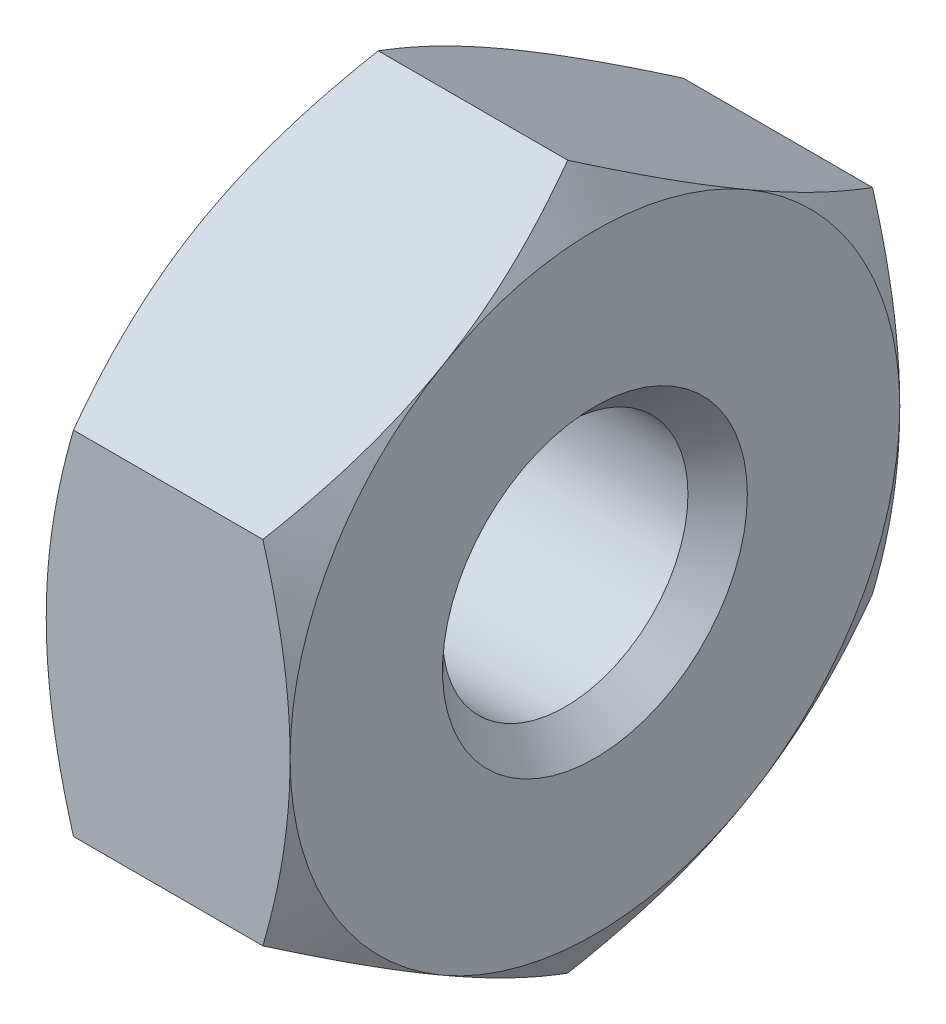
ISO-10303-21;
HEADER;
FILE_DESCRIPTION(('STEP AP214'),'2;1');
FILE_NAME('part.step','',(''),(''),'','','');
FILE_SCHEMA(('AUTOMOTIVE_DESIGN { 1 0 10303 214 1 1 1 1 }'));
ENDSEC;
DATA;
#1=APPLICATION_CONTEXT('core data for automotive mechanical design processes');
#2=APPLICATION_PROTOCOL_DEFINITION('international standard','automotive_design',2000,#1);
#3=PRODUCT_CONTEXT('',#1,'mechanical');
#4=PRODUCT('Part','Part','',(#3));
#5=PRODUCT_RELATED_PRODUCT_CATEGORY('part','',(#4));
#6=PRODUCT_DEFINITION_FORMATION('','',#4);
#7=PRODUCT_DEFINITION_CONTEXT('part definition',#1,'design');
#8=PRODUCT_DEFINITION('design','',#6,#7);
#9=PRODUCT_DEFINITION_SHAPE('','',#8);
#10=(LENGTH_UNIT() NAMED_UNIT(*) SI_UNIT(.MILLI.,.METRE.));
#11=(NAMED_UNIT(*) PLANE_ANGLE_UNIT() SI_UNIT($,.RADIAN.));
#12=(NAMED_UNIT(*) SI_UNIT($,.STERADIAN.) SOLID_ANGLE_UNIT());
#13=UNCERTAINTY_MEASURE_WITH_UNIT(LENGTH_MEASURE(1.E-05),#10,'distance_accuracy_value','');
#14=(GEOMETRIC_REPRESENTATION_CONTEXT(3) GLOBAL_UNCERTAINTY_ASSIGNED_CONTEXT((#13)) GLOBAL_UNIT_ASSIGNED_CONTEXT((#10,
#11,#12)) REPRESENTATION_CONTEXT('',''));
#15=CARTESIAN_POINT('',(0.,0.,0.));
#16=DIRECTION('',(0.,0.,1.));
#17=DIRECTION('',(1.,0.,0.));
#18=AXIS2_PLACEMENT_3D('',#15,#16,#17);
#19=CARTESIAN_POINT('',(1.77536926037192,0.,0.));
#20=DIRECTION('',(-1.,0.,0.));
#21=DIRECTION('',(0.,-1.,0.));
#22=AXIS2_PLACEMENT_3D('',#19,#20,#21);
#23=CONICAL_SURFACE('',#22,2.88907185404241,1.04719755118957);
#24=CARTESIAN_POINT('',(1.7767089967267,1.44337570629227,2.5));
#25=CARTESIAN_POINT('',(1.81063130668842,1.32586506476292,2.50000000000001));
#26=CARTESIAN_POINT('',(1.841713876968,1.20744425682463,2.50000000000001));
#27=CARTESIAN_POINT('',(1.89652772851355,0.969558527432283,2.50000000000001));
#28=CARTESIAN_POINT('',(1.92029536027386,0.850101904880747,2.50000000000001));
#29=CARTESIAN_POINT('',(1.95920267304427,0.609595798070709,2.50000000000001));
#30=CARTESIAN_POINT('',(1.97433270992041,0.488544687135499,2.50000000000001));
#31=CARTESIAN_POINT('',(1.9896432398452,0.306060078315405,2.50000000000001));
#32=CARTESIAN_POINT('',(1.99351636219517,0.244921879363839,2.50000000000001));
#33=CARTESIAN_POINT('',(1.99869890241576,0.122525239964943,2.50000000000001));
#34=CARTESIAN_POINT('',(2.0000078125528,0.0612667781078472,2.5));
#35=CARTESIAN_POINT('',(2.00000000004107,-7.49400541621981E-13,2.5));
#36=B_SPLINE_CURVE_WITH_KNOTS('',3,(#24,#25,#26,#27,#28,#29,#30,#31,#32,#33,#34,#35),
.UNSPECIFIED.,.F.,.F.,(4,2,2,2,2,4),(0.,0.367018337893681,0.732182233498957,1.09775305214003,
1.28148752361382,1.46525837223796),.UNSPECIFIED.);
#37=CARTESIAN_POINT('',(1.77670900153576,1.44337568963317,2.50000000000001));
#38=VERTEX_POINT('',#37);
#39=CARTESIAN_POINT('',(2.0000000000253,0.,2.5000000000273));
#40=VERTEX_POINT('',#39);
#41=EDGE_CURVE('E138',#38,#40,#36,.T.);
#42=ORIENTED_EDGE('',*,*,#41,.T.);
#43=CARTESIAN_POINT('',(2.00000000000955,0.,0.));
#44=DIRECTION('',(-1.,0.,0.));
#45=DIRECTION('',(0.,-1.,0.));
#46=AXIS2_PLACEMENT_3D('',#43,#44,#45);
#47=CIRCLE('',#46,2.50000000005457);
#48=CARTESIAN_POINT('',(2.0000000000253,2.16506350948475,1.25000000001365));
#49=VERTEX_POINT('',#48);
#50=EDGE_CURVE('E119',#49,#40,#47,.F.);
#51=ORIENTED_EDGE('',*,*,#50,.F.);
#52=CARTESIAN_POINT('',(2.00000000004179,2.16506350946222,1.25000000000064));
#53=CARTESIAN_POINT('',(2.00000781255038,2.13443012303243,1.30305858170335));
#54=CARTESIAN_POINT('',(1.99869890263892,2.10380089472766,1.35610996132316));
#55=CARTESIAN_POINT('',(1.99351636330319,2.04260258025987,1.46210855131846));
#56=CARTESIAN_POINT('',(1.98964324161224,2.01203348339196,1.51505578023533));
#57=CARTESIAN_POINT('',(1.97433271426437,1.92079118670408,1.67309207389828));
#58=CARTESIAN_POINT('',(1.95920267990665,1.86026563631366,1.77792540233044));
#59=CARTESIAN_POINT('',(1.92029537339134,1.74001259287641,1.98620978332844));
#60=CARTESIAN_POINT('',(1.89652774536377,1.68028428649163,2.08966224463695));
#61=CARTESIAN_POINT('',(1.8417139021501,1.5613414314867,2.29567731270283));
#62=CARTESIAN_POINT('',(1.81063133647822,1.50213103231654,2.39823273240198));
#63=CARTESIAN_POINT('',(1.7767090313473,1.44337571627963,2.4999999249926));
#64=B_SPLINE_CURVE_WITH_KNOTS('',3,(#52,#53,#54,#55,#56,#57,#58,#59,#60,#61,#62,#63),
.UNSPECIFIED.,.F.,.F.,(4,2,2,2,2,4),(0.,0.183770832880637,0.367505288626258,0.733076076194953,
1.09823994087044,1.46525824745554),.UNSPECIFIED.);
#65=EDGE_CURVE('E21',#49,#38,#64,.T.);
#66=ORIENTED_EDGE('',*,*,#65,.T.);
#67=EDGE_LOOP('',(#42,#51,#66));
#68=FACE_BOUND('',#67,.T.);
#69=ADVANCED_FACE('F17',(#68),#23,.T.);
#70=CARTESIAN_POINT('',(1.77536926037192,0.,0.));
#71=DIRECTION('',(-1.,0.,0.));
#72=DIRECTION('',(0.,-1.,0.));
#73=AXIS2_PLACEMENT_3D('',#70,#71,#72);
#74=CONICAL_SURFACE('',#73,2.88907185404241,1.04719755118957);
#75=CARTESIAN_POINT('',(2.00000000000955,0.,0.));
#76=DIRECTION('',(-1.,0.,0.));
#77=DIRECTION('',(0.,-1.,0.));
#78=AXIS2_PLACEMENT_3D('',#75,#76,#77);
#79=CIRCLE('',#78,2.50000000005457);
#80=CARTESIAN_POINT('',(2.00000000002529,-2.16506350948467,1.25000000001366));
#81=VERTEX_POINT('',#80);
#82=EDGE_CURVE('E146',#40,#81,#79,.F.);
#83=ORIENTED_EDGE('',*,*,#82,.F.);
#84=CARTESIAN_POINT('',(2.0000000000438,0.,2.50000000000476));
#85=CARTESIAN_POINT('',(2.0000078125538,-0.0612667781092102,2.50000000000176));
#86=CARTESIAN_POINT('',(1.99869890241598,-0.122525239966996,2.50000000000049));
#87=CARTESIAN_POINT('',(1.99351636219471,-0.244921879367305,2.49999999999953));
#88=CARTESIAN_POINT('',(1.98964323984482,-0.306060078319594,2.49999999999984));
#89=CARTESIAN_POINT('',(1.97433270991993,-0.488544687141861,2.50000000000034));
#90=CARTESIAN_POINT('',(1.95920267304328,-0.609595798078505,2.5000000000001));
#91=CARTESIAN_POINT('',(1.92029536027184,-0.850101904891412,2.49999999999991));
#92=CARTESIAN_POINT('',(1.89652772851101,-0.969558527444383,2.49999999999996));
#93=CARTESIAN_POINT('',(1.84171387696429,-1.20744425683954,2.50000000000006));
#94=CARTESIAN_POINT('',(1.81063130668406,-1.3258650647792,2.50000000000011));
#95=CARTESIAN_POINT('',(1.77670899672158,-1.44337570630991,2.50000000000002));
#96=B_SPLINE_CURVE_WITH_KNOTS('',3,(#84,#85,#86,#87,#88,#89,#90,#91,#92,#93,#94,#95),
.UNSPECIFIED.,.F.,.F.,(4,2,2,2,2,4),(0.,0.183770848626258,0.367505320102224,0.733076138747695,
1.09824003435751,1.46525837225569),.UNSPECIFIED.);
#97=CARTESIAN_POINT('',(1.77670901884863,-1.44337569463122,2.49999996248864));
#98=VERTEX_POINT('',#97);
#99=EDGE_CURVE('E296',#40,#98,#96,.T.);
#100=ORIENTED_EDGE('',*,*,#99,.T.);
#101=CARTESIAN_POINT('',(1.77670903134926,-1.44337571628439,2.49999992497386));
#102=CARTESIAN_POINT('',(1.81063133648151,-1.50213103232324,2.39823273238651));
#103=CARTESIAN_POINT('',(1.84171390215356,-1.5613414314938,2.29567731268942));
#104=CARTESIAN_POINT('',(1.89652774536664,-1.68028428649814,2.08966224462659));
#105=CARTESIAN_POINT('',(1.92029537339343,-1.74001259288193,1.98620978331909));
#106=CARTESIAN_POINT('',(1.95920267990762,-1.86026563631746,1.77792540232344));
#107=CARTESIAN_POINT('',(1.97433271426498,-1.92079118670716,1.67309207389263));
#108=CARTESIAN_POINT('',(1.98964324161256,-2.01203348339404,1.51505578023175));
#109=CARTESIAN_POINT('',(1.99351636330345,-2.04260258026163,1.46210855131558));
#110=CARTESIAN_POINT('',(1.99869890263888,-2.10380089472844,1.35610996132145));
#111=CARTESIAN_POINT('',(2.00000781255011,-2.13443012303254,1.30305858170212));
#112=CARTESIAN_POINT('',(2.00000000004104,-2.1650635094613,1.24999999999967));
#113=B_SPLINE_CURVE_WITH_KNOTS('',3,(#101,#102,#103,#104,#105,#106,#107,#108,#109,#110,#111,
#112),.UNSPECIFIED.,.F.,.F.,(4,2,2,2,2,4),(0.,0.367018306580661,0.732182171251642,
1.09775295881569,1.28148741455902,1.4652582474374),.UNSPECIFIED.);
#114=EDGE_CURVE('E304',#98,#81,#113,.T.);
#115=ORIENTED_EDGE('',*,*,#114,.T.);
#116=EDGE_LOOP('',(#83,#100,#115));
#117=FACE_BOUND('',#116,.T.);
#118=ADVANCED_FACE('F311',(#117),#74,.T.);
#119=CARTESIAN_POINT('',(1.77536926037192,0.,0.));
#120=DIRECTION('',(-1.,0.,0.));
#121=DIRECTION('',(0.,-1.,0.));
#122=AXIS2_PLACEMENT_3D('',#119,#120,#121);
#123=CONICAL_SURFACE('',#122,2.88907185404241,1.04719755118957);
#124=CARTESIAN_POINT('',(2.00000000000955,0.,0.));
#125=DIRECTION('',(-1.,0.,0.));
#126=DIRECTION('',(0.,-1.,0.));
#127=AXIS2_PLACEMENT_3D('',#124,#125,#126);
#128=CIRCLE('',#127,2.50000000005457);
#129=CARTESIAN_POINT('',(2.00000000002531,-2.16506350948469,-1.25000000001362));
#130=VERTEX_POINT('',#129);
#131=CARTESIAN_POINT('',(2.0000000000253,0.,-2.50000000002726));
#132=VERTEX_POINT('',#131);
#133=EDGE_CURVE('E332',#130,#132,#128,.F.);
#134=ORIENTED_EDGE('',*,*,#133,.F.);
#135=CARTESIAN_POINT('',(2.00000000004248,-2.16506350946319,-1.25000000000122));
#136=CARTESIAN_POINT('',(2.00000781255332,-2.13443012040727,-1.30305858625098));
#137=CARTESIAN_POINT('',(1.99869890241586,-2.10380088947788,-1.35610997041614));
#138=CARTESIAN_POINT('',(1.99351636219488,-2.04260256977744,-1.46210856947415));
#139=CARTESIAN_POINT('',(1.98964323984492,-2.01203347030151,-1.5150558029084));
#140=CARTESIAN_POINT('',(1.97433270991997,-1.92079116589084,-1.67309210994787));
#141=CARTESIAN_POINT('',(1.95920267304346,-1.86026561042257,-1.777925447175));
#142=CARTESIAN_POINT('',(1.92029536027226,-1.74001255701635,-1.98620984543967));
#143=CARTESIAN_POINT('',(1.89652772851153,-1.68028424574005,-2.08966231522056));
#144=CARTESIAN_POINT('',(1.84171387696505,-1.56134138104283,-2.29567740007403));
#145=CARTESIAN_POINT('',(1.81063130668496,-1.50213097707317,-2.3982328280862));
#146=CARTESIAN_POINT('',(1.77670899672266,-1.44337565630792,-2.50000002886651));
#147=B_SPLINE_CURVE_WITH_KNOTS('',3,(#135,#136,#137,#138,#139,#140,#141,#142,#143,#144,#145,
#146),.UNSPECIFIED.,.F.,.F.,(4,2,2,2,2,4),(0.,0.183770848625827,0.367505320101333,
0.733076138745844,1.09824003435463,1.4652583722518),.UNSPECIFIED.);
#148=CARTESIAN_POINT('',(1.77670901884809,-1.44337562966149,-2.49999999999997));
#149=VERTEX_POINT('',#148);
#150=EDGE_CURVE('E474',#130,#149,#147,.T.);
#151=ORIENTED_EDGE('',*,*,#150,.T.);
#152=CARTESIAN_POINT('',(1.77670903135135,-1.44337558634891,-2.49999999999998));
#153=CARTESIAN_POINT('',(1.81063133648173,-1.3258649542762,-2.49999999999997));
#154=CARTESIAN_POINT('',(1.84171390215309,-1.20744415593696,-2.49999999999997));
#155=CARTESIAN_POINT('',(1.89652774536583,-0.969558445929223,-2.49999999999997));
#156=CARTESIAN_POINT('',(1.92029537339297,-0.85010183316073,-2.49999999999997));
#157=CARTESIAN_POINT('',(1.95920267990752,-0.609595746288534,-2.49999999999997));
#158=CARTESIAN_POINT('',(1.97433271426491,-0.488544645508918,-2.49999999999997));
#159=CARTESIAN_POINT('',(1.98964324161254,-0.30606005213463,-2.49999999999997));
#160=CARTESIAN_POINT('',(1.99351636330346,-0.244921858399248,-2.49999999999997));
#161=CARTESIAN_POINT('',(1.99869890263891,-0.122525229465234,-2.49999999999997));
#162=CARTESIAN_POINT('',(2.00000781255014,-0.0612667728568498,-2.49999999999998));
#163=CARTESIAN_POINT('',(2.00000000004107,8.04911692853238E-13,-2.5));
#164=B_SPLINE_CURVE_WITH_KNOTS('',3,(#152,#153,#154,#155,#156,#157,#158,#159,#160,#161,#162,
#163),.UNSPECIFIED.,.F.,.F.,(4,2,2,2,2,4),(0.,0.367018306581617,0.732182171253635,
1.09775295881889,1.28148741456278,1.4652582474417),.UNSPECIFIED.);
#165=EDGE_CURVE('E303',#149,#132,#164,.T.);
#166=ORIENTED_EDGE('',*,*,#165,.T.);
#167=EDGE_LOOP('',(#134,#151,#166));
#168=FACE_BOUND('',#167,.T.);
#169=ADVANCED_FACE('F173',(#168),#123,.T.);
#170=CARTESIAN_POINT('',(1.77536926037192,0.,0.));
#171=DIRECTION('',(-1.,0.,0.));
#172=DIRECTION('',(0.,-1.,0.));
#173=AXIS2_PLACEMENT_3D('',#170,#171,#172);
#174=CONICAL_SURFACE('',#173,2.88907185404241,1.04719755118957);
#175=CARTESIAN_POINT('',(1.77670899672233,1.44337565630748,-2.50000002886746));
#176=CARTESIAN_POINT('',(1.81063130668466,1.50213097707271,-2.39823282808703));
#177=CARTESIAN_POINT('',(1.84171387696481,1.56134138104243,-2.29567740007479));
#178=CARTESIAN_POINT('',(1.8965277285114,1.68028424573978,-2.08966231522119));
#179=CARTESIAN_POINT('',(1.92029536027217,1.74001255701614,-1.98620984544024));
#180=CARTESIAN_POINT('',(1.95920267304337,1.86026561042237,-1.77792544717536));
#181=CARTESIAN_POINT('',(1.97433270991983,1.92079116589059,-1.67309210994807));
#182=CARTESIAN_POINT('',(1.98964323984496,2.01203347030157,-1.51505580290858));
#183=CARTESIAN_POINT('',(1.99351636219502,2.04260256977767,-1.46210856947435));
#184=CARTESIAN_POINT('',(1.99869890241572,2.10380088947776,-1.35610997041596));
#185=CARTESIAN_POINT('',(2.0000078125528,2.13443012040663,-1.30305858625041));
#186=CARTESIAN_POINT('',(2.00000000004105,2.16506350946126,-1.24999999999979));
#187=B_SPLINE_CURVE_WITH_KNOTS('',3,(#175,#176,#177,#178,#179,#180,#181,#182,#183,#184,#185,
#186),.UNSPECIFIED.,.F.,.F.,(4,2,2,2,2,4),(0.,0.367018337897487,0.732182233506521,
1.09775305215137,1.28148752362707,1.46525837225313),.UNSPECIFIED.);
#188=CARTESIAN_POINT('',(1.77670900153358,1.44337566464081,-2.50000001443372));
#189=VERTEX_POINT('',#188);
#190=CARTESIAN_POINT('',(2.0000000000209,2.16506350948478,-1.25000000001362));
#191=VERTEX_POINT('',#190);
#192=EDGE_CURVE('E147',#189,#191,#187,.T.);
#193=ORIENTED_EDGE('',*,*,#192,.T.);
#194=CARTESIAN_POINT('',(2.00000000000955,0.,0.));
#195=DIRECTION('',(-1.,0.,0.));
#196=DIRECTION('',(0.,-1.,0.));
#197=AXIS2_PLACEMENT_3D('',#194,#195,#196);
#198=CIRCLE('',#197,2.50000000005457);
#199=EDGE_CURVE('E122',#132,#191,#198,.F.);
#200=ORIENTED_EDGE('',*,*,#199,.F.);
#201=CARTESIAN_POINT('',(2.0000000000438,0.,-2.50000000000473));
#202=CARTESIAN_POINT('',(2.00000781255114,0.0612667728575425,-2.50000000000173));
#203=CARTESIAN_POINT('',(1.99869890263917,0.122525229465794,-2.50000000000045));
#204=CARTESIAN_POINT('',(1.99351636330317,0.244921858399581,-2.49999999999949));
#205=CARTESIAN_POINT('',(1.98964324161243,0.306060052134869,-2.4999999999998));
#206=CARTESIAN_POINT('',(1.9743327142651,0.488544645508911,-2.50000000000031));
#207=CARTESIAN_POINT('',(1.9592026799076,0.609595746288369,-2.50000000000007));
#208=CARTESIAN_POINT('',(1.920295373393,0.85010183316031,-2.49999999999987));
#209=CARTESIAN_POINT('',(1.89652774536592,0.969558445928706,-2.49999999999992));
#210=CARTESIAN_POINT('',(1.84171390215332,1.20744415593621,-2.50000000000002));
#211=CARTESIAN_POINT('',(1.81063133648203,1.32586495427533,-2.50000000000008));
#212=CARTESIAN_POINT('',(1.77670903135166,1.44337558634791,-2.5));
#213=B_SPLINE_CURVE_WITH_KNOTS('',3,(#201,#202,#203,#204,#205,#206,#207,#208,#209,#210,#211,
#212),.UNSPECIFIED.,.F.,.F.,(4,2,2,2,2,4),(0.,0.183770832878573,0.367505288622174,
0.733076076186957,1.09823994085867,1.46525824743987),.UNSPECIFIED.);
#214=EDGE_CURVE('E151',#132,#189,#213,.T.);
#215=ORIENTED_EDGE('',*,*,#214,.T.);
#216=EDGE_LOOP('',(#193,#200,#215));
#217=FACE_BOUND('',#216,.T.);
#218=ADVANCED_FACE('F168',(#217),#174,.T.);
#219=CARTESIAN_POINT('',(2.,1.87500000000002,0.));
#220=DIRECTION('',(1.,0.,0.));
#221=DIRECTION('',(0.,0.,-1.));
#222=AXIS2_PLACEMENT_3D('',#219,#220,#221);
#223=PLANE('',#222);
#224=CARTESIAN_POINT('',(2.00000000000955,0.,0.));
#225=DIRECTION('',(1.,0.,0.));
#226=DIRECTION('',(0.,0.,-1.));
#227=AXIS2_PLACEMENT_3D('',#224,#225,#226);
#228=CIRCLE('',#227,1.25000000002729);
#229=CARTESIAN_POINT('',(2.00000000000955,0.,-1.25000000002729));
#230=VERTEX_POINT('',#229);
#231=EDGE_CURVE('E126',#230,#230,#228,.F.);
#232=ORIENTED_EDGE('',*,*,#231,.T.);
#233=EDGE_LOOP('',(#232));
#234=FACE_BOUND('',#233,.T.);
#235=ORIENTED_EDGE('',*,*,#199,.T.);
#236=CARTESIAN_POINT('',(2.00000000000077,0.,0.));
#237=DIRECTION('',(-1.,0.,0.));
#238=DIRECTION('',(0.,-1.,0.));
#239=AXIS2_PLACEMENT_3D('',#236,#237,#238);
#240=CIRCLE('',#239,2.50000000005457);
#241=EDGE_CURVE('E114',#191,#49,#240,.F.);
#242=ORIENTED_EDGE('',*,*,#241,.T.);
#243=ORIENTED_EDGE('',*,*,#50,.T.);
#244=ORIENTED_EDGE('',*,*,#82,.T.);
#245=CARTESIAN_POINT('',(2.00000000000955,0.,0.));
#246=DIRECTION('',(-1.,0.,0.));
#247=DIRECTION('',(0.,-1.,0.));
#248=AXIS2_PLACEMENT_3D('',#245,#246,#247);
#249=CIRCLE('',#248,2.50000000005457);
#250=EDGE_CURVE('E149',#81,#130,#249,.F.);
#251=ORIENTED_EDGE('',*,*,#250,.T.);
#252=ORIENTED_EDGE('',*,*,#133,.T.);
#253=EDGE_LOOP('',(#235,#242,#243,#244,#251,#252));
#254=FACE_BOUND('',#253,.T.);
#255=ADVANCED_FACE('F116',(#234,#254),#223,.T.);
#256=CARTESIAN_POINT('',(1.99999999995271,0.,0.));
#257=DIRECTION('',(1.,0.,0.));
#258=DIRECTION('',(0.,0.,-1.));
#259=AXIS2_PLACEMENT_3D('',#256,#257,#258);
#260=CONICAL_SURFACE('',#259,1.24999999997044,0.78539816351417);
#261=ORIENTED_EDGE('',*,*,#231,.F.);
#262=EDGE_LOOP('',(#261));
#263=FACE_BOUND('',#262,.T.);
#264=CARTESIAN_POINT('',(1.75650000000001,0.,0.));
#265=DIRECTION('',(1.,0.,0.));
#266=DIRECTION('',(0.,1.,0.));
#267=AXIS2_PLACEMENT_3D('',#264,#265,#266);
#268=CIRCLE('',#267,1.0065);
#269=CARTESIAN_POINT('',(1.75650000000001,1.00650000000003,0.));
#270=VERTEX_POINT('',#269);
#271=EDGE_CURVE('E336',#270,#270,#268,.F.);
#272=ORIENTED_EDGE('',*,*,#271,.T.);
#273=EDGE_LOOP('',(#272));
#274=FACE_BOUND('',#273,.T.);
#275=ADVANCED_FACE('F180',(#263,#274),#260,.F.);
#276=CARTESIAN_POINT('',(1.77536926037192,0.,0.));
#277=DIRECTION('',(-1.,0.,0.));
#278=DIRECTION('',(0.,-1.,0.));
#279=AXIS2_PLACEMENT_3D('',#276,#277,#278);
#280=CONICAL_SURFACE('',#279,2.88907185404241,1.04719755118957);
#281=ORIENTED_EDGE('',*,*,#250,.F.);
#282=CARTESIAN_POINT('',(2.00000000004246,-2.16506350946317,1.25000000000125));
#283=CARTESIAN_POINT('',(2.00000781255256,-2.19569689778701,1.19694141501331));
#284=CARTESIAN_POINT('',(1.99869890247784,-2.22632612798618,1.14389003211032));
#285=CARTESIAN_POINT('',(1.99351636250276,-2.2875244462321,1.03789143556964));
#286=CARTESIAN_POINT('',(1.9896432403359,-2.31809354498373,0.98494420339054));
#287=CARTESIAN_POINT('',(1.97433271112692,-2.4093358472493,0.826907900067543));
#288=CARTESIAN_POINT('',(1.95920267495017,-2.46986140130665,0.722074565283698));
#289=CARTESIAN_POINT('',(1.92029536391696,-2.59011445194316,0.513790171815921));
#290=CARTESIAN_POINT('',(1.89652773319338,-2.64984276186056,0.410337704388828));
#291=CARTESIAN_POINT('',(1.8417138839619,-2.76878562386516,0.204322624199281));
#292=CARTESIAN_POINT('',(1.81063131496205,-2.82799602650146,0.101767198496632));
#293=CARTESIAN_POINT('',(1.776709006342,-2.886751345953,-8.50187975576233E-12));
#294=B_SPLINE_CURVE_WITH_KNOTS('',3,(#282,#283,#284,#285,#286,#287,#288,#289,#290,#291,#292,
#293),.UNSPECIFIED.,.F.,.F.,(4,2,2,2,2,4),(0.,0.183770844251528,0.367505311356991,
0.733076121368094,1.09824000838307,1.46525833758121),.UNSPECIFIED.);
#295=CARTESIAN_POINT('',(1.77670900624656,-2.88675134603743,4.2708891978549E-12));
#296=VERTEX_POINT('',#295);
#297=EDGE_CURVE('E193',#81,#296,#294,.T.);
#298=ORIENTED_EDGE('',*,*,#297,.T.);
#299=CARTESIAN_POINT('',(1.776709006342,-2.88675134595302,8.53830894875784E-12));
#300=CARTESIAN_POINT('',(1.81063131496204,-2.82799602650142,-0.101767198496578));
#301=CARTESIAN_POINT('',(1.8417138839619,-2.76878562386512,-0.204322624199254));
#302=CARTESIAN_POINT('',(1.89652773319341,-2.64984276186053,-0.410337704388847));
#303=CARTESIAN_POINT('',(1.92029536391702,-2.59011445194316,-0.513790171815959));
#304=CARTESIAN_POINT('',(1.95920267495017,-2.46986140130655,-0.722074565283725));
#305=CARTESIAN_POINT('',(1.97433271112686,-2.40933584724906,-0.826907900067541));
#306=CARTESIAN_POINT('',(1.98964324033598,-2.31809354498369,-0.984944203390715));
#307=CARTESIAN_POINT('',(1.99351636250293,-2.28752444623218,-1.03789143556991));
#308=CARTESIAN_POINT('',(1.99869890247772,-2.22632612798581,-1.14389003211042));
#309=CARTESIAN_POINT('',(2.00000781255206,-2.19569689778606,-1.19694141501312));
#310=CARTESIAN_POINT('',(2.00000000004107,-2.16506350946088,-1.25000000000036));
#311=B_SPLINE_CURVE_WITH_KNOTS('',3,(#299,#300,#301,#302,#303,#304,#305,#306,#307,#308,#309,
#310),.UNSPECIFIED.,.F.,.F.,(4,2,2,2,2,4),(0.,0.367018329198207,0.732182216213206,
1.09775302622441,1.28148749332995,1.46525833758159),.UNSPECIFIED.);
#312=EDGE_CURVE('E199',#296,#130,#311,.T.);
#313=ORIENTED_EDGE('',*,*,#312,.T.);
#314=EDGE_LOOP('',(#281,#298,#313));
#315=FACE_BOUND('',#314,.T.);
#316=ADVANCED_FACE('F184',(#315),#280,.T.);
#317=CARTESIAN_POINT('',(1.77536926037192,0.,0.));
#318=DIRECTION('',(-1.,0.,0.));
#319=DIRECTION('',(0.,-1.,0.));
#320=AXIS2_PLACEMENT_3D('',#317,#318,#319);
#321=CONICAL_SURFACE('',#320,2.88907185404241,1.04719755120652);
#322=CARTESIAN_POINT('',(1.77670900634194,2.88675134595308,-8.50708392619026E-12));
#323=CARTESIAN_POINT('',(1.81063131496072,2.82799602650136,0.101767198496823));
#324=CARTESIAN_POINT('',(1.8417138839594,2.76878562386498,0.204322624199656));
#325=CARTESIAN_POINT('',(1.89652773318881,2.64984276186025,0.410337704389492));
#326=CARTESIAN_POINT('',(1.92029536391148,2.59011445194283,0.513790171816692));
#327=CARTESIAN_POINT('',(1.95920267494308,2.46986140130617,0.722074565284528));
#328=CARTESIAN_POINT('',(1.97433271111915,2.4093358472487,0.826907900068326));
#329=CARTESIAN_POINT('',(1.98964324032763,2.31809354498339,0.984944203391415));
#330=CARTESIAN_POINT('',(1.99351636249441,2.28752444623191,1.03789143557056));
#331=CARTESIAN_POINT('',(1.99869890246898,2.22632612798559,1.14389003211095));
#332=CARTESIAN_POINT('',(2.00000781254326,2.19569689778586,1.19694141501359));
#333=CARTESIAN_POINT('',(2.00000000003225,2.16506350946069,1.25000000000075));
#334=B_SPLINE_CURVE_WITH_KNOTS('',3,(#322,#323,#324,#325,#326,#327,#328,#329,#330,#331,#332,
#333),.UNSPECIFIED.,.F.,.F.,(4,2,2,2,2,4),(0.,0.367018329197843,0.732182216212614,
1.09775302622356,1.2814874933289,1.46525833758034),.UNSPECIFIED.);
#335=CARTESIAN_POINT('',(1.77670900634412,2.88675134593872,0.));
#336=VERTEX_POINT('',#335);
#337=EDGE_CURVE('E133',#336,#49,#334,.T.);
#338=ORIENTED_EDGE('',*,*,#337,.T.);
#339=ORIENTED_EDGE('',*,*,#241,.F.);
#340=CARTESIAN_POINT('',(2.00000000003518,2.16506350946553,-1.25000000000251));
#341=CARTESIAN_POINT('',(2.00000781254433,2.19569689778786,-1.19694141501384));
#342=CARTESIAN_POINT('',(1.99869890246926,2.22632612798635,-1.14389003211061));
#343=CARTESIAN_POINT('',(1.9935163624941,2.28752444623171,-1.03789143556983));
#344=CARTESIAN_POINT('',(1.98964324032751,2.31809354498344,-0.9849442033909));
#345=CARTESIAN_POINT('',(1.97433271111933,2.40933584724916,-0.826907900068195));
#346=CARTESIAN_POINT('',(1.95920267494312,2.46986140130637,-0.72207456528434));
#347=CARTESIAN_POINT('',(1.92029536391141,2.5901144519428,-0.513790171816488));
#348=CARTESIAN_POINT('',(1.89652773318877,2.64984276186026,-0.410337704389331));
#349=CARTESIAN_POINT('',(1.84171388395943,2.76878562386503,-0.204322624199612));
#350=CARTESIAN_POINT('',(1.81063131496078,2.82799602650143,-0.101767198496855));
#351=CARTESIAN_POINT('',(1.77670900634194,2.88675134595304,8.47238945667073E-12));
#352=B_SPLINE_CURVE_WITH_KNOTS('',3,(#340,#341,#342,#343,#344,#345,#346,#347,#348,#349,#350,
#351),.UNSPECIFIED.,.F.,.F.,(4,2,2,2,2,4),(0.,0.183770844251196,0.367505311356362,
0.733076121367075,1.09824000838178,1.46525833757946),.UNSPECIFIED.);
#353=EDGE_CURVE('E140',#191,#336,#352,.T.);
#354=ORIENTED_EDGE('',*,*,#353,.T.);
#355=EDGE_LOOP('',(#338,#339,#354));
#356=FACE_BOUND('',#355,.T.);
#357=ADVANCED_FACE('F139',(#356),#321,.T.);
#358=CARTESIAN_POINT('',(1.,0.,0.));
#359=DIRECTION('',(1.,0.,0.));
#360=DIRECTION('',(0.,1.,0.));
#361=AXIS2_PLACEMENT_3D('',#358,#359,#360);
#362=CYLINDRICAL_SURFACE('',#361,1.0065);
#363=ORIENTED_EDGE('',*,*,#271,.F.);
#364=EDGE_LOOP('',(#363));
#365=FACE_BOUND('',#364,.T.);
#366=CARTESIAN_POINT('',(0.243500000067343,0.,0.));
#367=DIRECTION('',(-1.,0.,0.));
#368=DIRECTION('',(0.,1.,0.));
#369=AXIS2_PLACEMENT_3D('',#366,#367,#368);
#370=CIRCLE('',#369,1.00650000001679);
#371=CARTESIAN_POINT('',(0.24350000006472,1.00649999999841,0.));
#372=VERTEX_POINT('',#371);
#373=CARTESIAN_POINT('',(0.243500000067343,-1.00650000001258,0.));
#374=VERTEX_POINT('',#373);
#375=EDGE_CURVE('E394',#372,#374,#370,.T.);
#376=ORIENTED_EDGE('',*,*,#375,.T.);
#377=CARTESIAN_POINT('',(0.243500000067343,0.,0.));
#378=DIRECTION('',(-1.,0.,0.));
#379=DIRECTION('',(0.,1.,0.));
#380=AXIS2_PLACEMENT_3D('',#377,#378,#379);
#381=CIRCLE('',#380,1.00650000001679);
#382=EDGE_CURVE('E400',#374,#372,#381,.T.);
#383=ORIENTED_EDGE('',*,*,#382,.T.);
#384=EDGE_LOOP('',(#376,#383));
#385=FACE_BOUND('',#384,.T.);
#386=ADVANCED_FACE('F415',(#365,#385),#362,.F.);
#387=CARTESIAN_POINT('',(2.99999999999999,2.88675134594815,0.));
#388=DIRECTION('',(0.,-0.866025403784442,0.500000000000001));
#389=DIRECTION('',(0.,-0.500000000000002,-0.866025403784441));
#390=AXIS2_PLACEMENT_3D('',#387,#388,#389);
#391=PLANE('',#390);
#392=CARTESIAN_POINT('',(0.223290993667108,2.8867513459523,7.14359127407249E-12));
#393=CARTESIAN_POINT('',(0.189368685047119,2.82799602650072,-0.101767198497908));
#394=CARTESIAN_POINT('',(0.158286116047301,2.76878562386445,-0.204322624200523));
#395=CARTESIAN_POINT('',(0.103472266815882,2.64984276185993,-0.410337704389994));
#396=CARTESIAN_POINT('',(0.0797046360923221,2.59011445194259,-0.513790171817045));
#397=CARTESIAN_POINT('',(0.0407973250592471,2.46986140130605,-0.722074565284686));
#398=CARTESIAN_POINT('',(0.0256672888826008,2.40933584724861,-0.826907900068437));
#399=CARTESIAN_POINT('',(0.0103567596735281,2.3180935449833,-0.984944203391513));
#400=CARTESIAN_POINT('',(0.00648363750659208,2.28752444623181,-1.03789143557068));
#401=CARTESIAN_POINT('',(0.00130109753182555,2.22632612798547,-1.14389003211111));
#402=CARTESIAN_POINT('',(-7.81254251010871E-06,2.19569689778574,-1.19694141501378));
#403=CARTESIAN_POINT('',(-3.15164561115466E-11,2.16506350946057,-1.25000000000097));
#404=B_SPLINE_CURVE_WITH_KNOTS('',3,(#392,#393,#394,#395,#396,#397,#398,#399,#400,#401,#402,
#403),.UNSPECIFIED.,.F.,.F.,(4,2,2,2,2,4),(0.,0.367018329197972,0.732182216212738,
1.09775302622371,1.28148749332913,1.46525833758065),.UNSPECIFIED.);
#405=CARTESIAN_POINT('',(0.223290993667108,2.88675134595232,0.));
#406=VERTEX_POINT('',#405);
#407=CARTESIAN_POINT('',(-1.57512891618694E-11,2.16506350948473,-1.25000000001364));
#408=VERTEX_POINT('',#407);
#409=EDGE_CURVE('E440',#406,#408,#404,.T.);
#410=ORIENTED_EDGE('',*,*,#409,.F.);
#411=DIRECTION('',(1.,0.,0.));
#412=VECTOR('',#411,1.);
#413=CARTESIAN_POINT('',(2.99999999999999,2.88675134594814,0.));
#414=LINE('',#413,#412);
#415=EDGE_CURVE('E142',#406,#336,#414,.T.);
#416=ORIENTED_EDGE('',*,*,#415,.T.);
#417=ORIENTED_EDGE('',*,*,#353,.F.);
#418=ORIENTED_EDGE('',*,*,#192,.F.);
#419=DIRECTION('',(1.,0.,0.));
#420=VECTOR('',#419,1.);
#421=CARTESIAN_POINT('',(2.99999999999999,1.4433756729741,-2.49999999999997));
#422=LINE('',#421,#420);
#423=CARTESIAN_POINT('',(0.223290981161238,1.44337562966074,-2.50000000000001));
#424=VERTEX_POINT('',#423);
#425=EDGE_CURVE('E207',#189,#424,#422,.F.);
#426=ORIENTED_EDGE('',*,*,#425,.T.);
#427=CARTESIAN_POINT('',(-3.54438700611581E-11,2.16506350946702,-1.2500000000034));
#428=CARTESIAN_POINT('',(-7.81254468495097E-06,2.13443012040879,-1.30305858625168));
#429=CARTESIAN_POINT('',(0.00130109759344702,2.10380088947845,-1.35610997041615));
#430=CARTESIAN_POINT('',(0.0064836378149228,2.04260256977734,-1.46210856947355));
#431=CARTESIAN_POINT('',(0.010356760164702,2.0120334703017,-1.51505580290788));
#432=CARTESIAN_POINT('',(0.0256672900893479,1.92079116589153,-1.6730921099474));
#433=CARTESIAN_POINT('',(0.0407973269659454,1.86026561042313,-1.77792544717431));
#434=CARTESIAN_POINT('',(0.0797046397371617,1.74001255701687,-1.98620984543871));
#435=CARTESIAN_POINT('',(0.103472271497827,1.68028424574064,-2.08966231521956));
#436=CARTESIAN_POINT('',(0.158286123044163,1.56134138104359,-2.29567740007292));
#437=CARTESIAN_POINT('',(0.189368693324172,1.50213097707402,-2.39823282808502));
#438=CARTESIAN_POINT('',(0.223291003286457,1.44337565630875,-2.50000002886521));
#439=B_SPLINE_CURVE_WITH_KNOTS('',3,(#427,#428,#429,#430,#431,#432,#433,#434,#435,#436,#437,
#438),.UNSPECIFIED.,.F.,.F.,(4,2,2,2,2,4),(0.,0.183770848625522,0.367505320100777,
0.733076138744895,1.09824003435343,1.46525837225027),.UNSPECIFIED.);
#440=EDGE_CURVE('E241',#408,#424,#439,.T.);
#441=ORIENTED_EDGE('',*,*,#440,.F.);
#442=EDGE_LOOP('',(#410,#416,#417,#418,#426,#441));
#443=FACE_BOUND('',#442,.T.);
#444=ADVANCED_FACE('F165',(#443),#391,.F.);
#445=CARTESIAN_POINT('',(2.99999999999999,1.4433756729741,-2.49999999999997));
#446=DIRECTION('',(0.,0.,1.));
#447=DIRECTION('',(1.,0.,0.));
#448=AXIS2_PLACEMENT_3D('',#445,#446,#447);
#449=PLANE('',#448);
#450=CARTESIAN_POINT('',(0.223290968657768,1.44337558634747,-2.5));
#451=CARTESIAN_POINT('',(0.189368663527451,1.32586495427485,-2.49999999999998));
#452=CARTESIAN_POINT('',(0.158286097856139,1.20744415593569,-2.49999999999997));
#453=CARTESIAN_POINT('',(0.103472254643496,0.969558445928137,-2.49999999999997));
#454=CARTESIAN_POINT('',(0.0797046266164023,0.850101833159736,-2.49999999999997));
#455=CARTESIAN_POINT('',(0.0407973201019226,0.609595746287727,-2.49999999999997));
#456=CARTESIAN_POINT('',(0.0256672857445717,0.488544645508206,-2.49999999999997));
#457=CARTESIAN_POINT('',(0.010356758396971,0.306060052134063,-2.49999999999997));
#458=CARTESIAN_POINT('',(0.00648363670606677,0.244921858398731,-2.49999999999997));
#459=CARTESIAN_POINT('',(0.00130109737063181,0.122525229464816,-2.49999999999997));
#460=CARTESIAN_POINT('',(-7.81254058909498E-06,0.0612667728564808,-2.49999999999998));
#461=CARTESIAN_POINT('',(-3.15008436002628E-11,-1.12410081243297E-12,-2.5));
#462=B_SPLINE_CURVE_WITH_KNOTS('',3,(#450,#451,#452,#453,#454,#455,#456,#457,#458,#459,#460,
#461),.UNSPECIFIED.,.F.,.F.,(4,2,2,2,2,4),(0.,0.367018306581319,0.732182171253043,
1.097752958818,1.28148741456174,1.46525824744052),.UNSPECIFIED.);
#463=CARTESIAN_POINT('',(-1.57495544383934E-11,0.,-2.50000000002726));
#464=VERTEX_POINT('',#463);
#465=EDGE_CURVE('E454',#424,#464,#462,.T.);
#466=ORIENTED_EDGE('',*,*,#465,.F.);
#467=ORIENTED_EDGE('',*,*,#425,.F.);
#468=ORIENTED_EDGE('',*,*,#214,.F.);
#469=ORIENTED_EDGE('',*,*,#165,.F.);
#470=DIRECTION('',(1.,0.,0.));
#471=VECTOR('',#470,1.);
#472=CARTESIAN_POINT('',(3.,-1.44337567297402,-2.5));
#473=LINE('',#472,#471);
#474=CARTESIAN_POINT('',(0.223290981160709,-1.44337569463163,-2.49999996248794));
#475=VERTEX_POINT('',#474);
#476=EDGE_CURVE('E206',#149,#475,#473,.F.);
#477=ORIENTED_EDGE('',*,*,#476,.T.);
#478=CARTESIAN_POINT('',(-3.54421353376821E-11,0.,-2.50000000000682));
#479=CARTESIAN_POINT('',(-7.81254469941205E-06,-0.0612667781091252,-2.50000000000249));
#480=CARTESIAN_POINT('',(0.00130109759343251,-0.122525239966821,-2.50000000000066));
#481=CARTESIAN_POINT('',(0.00648363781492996,-0.244921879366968,-2.49999999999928));
#482=CARTESIAN_POINT('',(0.0103567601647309,-0.306060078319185,-2.49999999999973));
#483=CARTESIAN_POINT('',(0.0256672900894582,-0.488544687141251,-2.50000000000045));
#484=CARTESIAN_POINT('',(0.0407973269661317,-0.609595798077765,-2.50000000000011));
#485=CARTESIAN_POINT('',(0.0797046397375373,-0.850101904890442,-2.49999999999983));
#486=CARTESIAN_POINT('',(0.103472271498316,-0.969558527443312,-2.4999999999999));
#487=CARTESIAN_POINT('',(0.158286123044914,-1.20744425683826,-2.50000000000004));
#488=CARTESIAN_POINT('',(0.189368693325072,-1.3258650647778,-2.50000000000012));
#489=CARTESIAN_POINT('',(0.223291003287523,-1.4433757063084,-2.49999999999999));
#490=B_SPLINE_CURVE_WITH_KNOTS('',3,(#478,#479,#480,#481,#482,#483,#484,#485,#486,#487,#488,
#489),.UNSPECIFIED.,.F.,.F.,(4,2,2,2,2,4),(0.,0.18377084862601,0.367505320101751,
0.733076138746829,1.09824003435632,1.46525837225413),.UNSPECIFIED.);
#491=EDGE_CURVE('E240',#464,#475,#490,.T.);
#492=ORIENTED_EDGE('',*,*,#491,.F.);
#493=EDGE_LOOP('',(#466,#467,#468,#469,#477,#492));
#494=FACE_BOUND('',#493,.T.);
#495=ADVANCED_FACE('F216',(#494),#449,.F.);
#496=CARTESIAN_POINT('',(3.,-1.44337567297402,-2.5));
#497=DIRECTION('',(0.,0.866025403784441,0.500000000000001));
#498=DIRECTION('',(0.,-0.500000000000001,0.866025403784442));
#499=AXIS2_PLACEMENT_3D('',#496,#497,#498);
#500=PLANE('',#499);
#501=CARTESIAN_POINT('',(0.223290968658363,-1.44337571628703,-2.49999992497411));
#502=CARTESIAN_POINT('',(0.189368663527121,-1.50213103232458,-2.39823273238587));
#503=CARTESIAN_POINT('',(0.158286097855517,-1.56134143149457,-2.29567731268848));
#504=CARTESIAN_POINT('',(0.103472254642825,-1.68028428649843,-2.08966224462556));
#505=CARTESIAN_POINT('',(0.0797046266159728,-1.7400125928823,-1.98620978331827));
#506=CARTESIAN_POINT('',(0.0407973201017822,-1.86026563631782,-1.77792540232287));
#507=CARTESIAN_POINT('',(0.0256672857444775,-1.92079118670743,-1.67309207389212));
#508=CARTESIAN_POINT('',(0.0103567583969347,-2.01203348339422,-1.51505578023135));
#509=CARTESIAN_POINT('',(0.00648363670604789,-2.04260258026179,-1.46210855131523));
#510=CARTESIAN_POINT('',(0.00130109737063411,-2.10380089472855,-1.35610996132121));
#511=CARTESIAN_POINT('',(-7.81254058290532E-06,-2.13443012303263,-1.30305858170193));
#512=CARTESIAN_POINT('',(-3.15025783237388E-11,-2.16506350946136,-1.24999999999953));
#513=B_SPLINE_CURVE_WITH_KNOTS('',3,(#501,#502,#503,#504,#505,#506,#507,#508,#509,#510,#511,
#512),.UNSPECIFIED.,.F.,.F.,(4,2,2,2,2,4),(0.,0.367018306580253,0.732182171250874,
1.09775295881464,1.2814874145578,1.46525824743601),.UNSPECIFIED.);
#514=CARTESIAN_POINT('',(-3.21548343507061E-11,-2.16506350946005,-1.24999999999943));
#515=VERTEX_POINT('',#514);
#516=EDGE_CURVE('E233',#475,#515,#513,.T.);
#517=ORIENTED_EDGE('',*,*,#516,.F.);
#518=ORIENTED_EDGE('',*,*,#476,.F.);
#519=ORIENTED_EDGE('',*,*,#150,.F.);
#520=ORIENTED_EDGE('',*,*,#312,.F.);
#521=DIRECTION('',(1.,0.,0.));
#522=VECTOR('',#521,1.);
#523=CARTESIAN_POINT('',(3.,-2.88675134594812,0.));
#524=LINE('',#523,#522);
#525=CARTESIAN_POINT('',(0.223290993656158,-2.88675134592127,0.));
#526=VERTEX_POINT('',#525);
#527=EDGE_CURVE('E328',#296,#526,#524,.F.);
#528=ORIENTED_EDGE('',*,*,#527,.T.);
#529=CARTESIAN_POINT('',(-3.33899574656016E-11,-2.16506350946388,-1.25000000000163));
#530=CARTESIAN_POINT('',(-7.8125432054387E-06,-2.19569689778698,-1.19694141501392));
#531=CARTESIAN_POINT('',(0.00130109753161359,-2.22632612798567,-1.14389003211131));
#532=CARTESIAN_POINT('',(0.00648363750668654,-2.28752444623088,-1.03789143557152));
#533=CARTESIAN_POINT('',(0.0103567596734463,-2.31809354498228,-0.984944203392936));
#534=CARTESIAN_POINT('',(0.0256672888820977,-2.40933584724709,-0.826907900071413));
#535=CARTESIAN_POINT('',(0.0407973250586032,-2.46986140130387,-0.722074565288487));
#536=CARTESIAN_POINT('',(0.07970463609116,-2.59011445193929,-0.513790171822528));
#537=CARTESIAN_POINT('',(0.103472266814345,-2.64984276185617,-0.410337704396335));
#538=CARTESIAN_POINT('',(0.158286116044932,-2.76878562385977,-0.204322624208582));
#539=CARTESIAN_POINT('',(0.189368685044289,-2.82799602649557,-0.101767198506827));
#540=CARTESIAN_POINT('',(0.223290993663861,-2.8867513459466,-2.57086019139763E-12));
#541=B_SPLINE_CURVE_WITH_KNOTS('',3,(#529,#530,#531,#532,#533,#534,#535,#536,#537,#538,#539,
#540),.UNSPECIFIED.,.F.,.F.,(4,2,2,2,2,4),(0.,0.183770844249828,0.367505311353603,
0.733076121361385,1.09824000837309,1.46525833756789),.UNSPECIFIED.);
#542=EDGE_CURVE('E224',#515,#526,#541,.T.);
#543=ORIENTED_EDGE('',*,*,#542,.F.);
#544=EDGE_LOOP('',(#517,#518,#519,#520,#528,#543));
#545=FACE_BOUND('',#544,.T.);
#546=ADVANCED_FACE('F212',(#545),#500,.F.);
#547=CARTESIAN_POINT('',(3.,-2.88675134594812,0.));
#548=DIRECTION('',(0.,0.866025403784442,-0.500000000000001));
#549=DIRECTION('',(0.,0.500000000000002,0.866025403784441));
#550=AXIS2_PLACEMENT_3D('',#547,#548,#549);
#551=PLANE('',#550);
#552=ORIENTED_EDGE('',*,*,#527,.F.);
#553=ORIENTED_EDGE('',*,*,#297,.F.);
#554=ORIENTED_EDGE('',*,*,#114,.F.);
#555=DIRECTION('',(-1.,0.,0.));
#556=VECTOR('',#555,1.);
#557=CARTESIAN_POINT('',(2.99999999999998,-1.44337567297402,2.50000000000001));
#558=LINE('',#557,#556);
#559=CARTESIAN_POINT('',(0.223290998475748,-1.44337568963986,2.50000000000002));
#560=VERTEX_POINT('',#559);
#561=EDGE_CURVE('E388',#98,#560,#558,.T.);
#562=ORIENTED_EDGE('',*,*,#561,.T.);
#563=CARTESIAN_POINT('',(-3.5452543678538E-11,-2.16506350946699,1.25000000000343));
#564=CARTESIAN_POINT('',(-7.81254202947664E-06,-2.13443012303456,1.30305858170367));
#565=CARTESIAN_POINT('',(0.00130109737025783,-2.1038008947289,1.35610996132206));
#566=CARTESIAN_POINT('',(0.006483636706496,-2.04260258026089,1.46210855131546));
#567=CARTESIAN_POINT('',(0.0103567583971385,-2.01203348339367,1.51505578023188));
#568=CARTESIAN_POINT('',(0.0256672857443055,-1.92079118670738,1.67309207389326));
#569=CARTESIAN_POINT('',(0.0407973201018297,-1.86026563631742,1.77792540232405));
#570=CARTESIAN_POINT('',(0.0797046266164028,-1.74001259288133,1.9862097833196));
#571=CARTESIAN_POINT('',(0.103472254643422,-1.68028428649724,2.08966224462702));
#572=CARTESIAN_POINT('',(0.1582860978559,-1.56134143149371,2.2956773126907));
#573=CARTESIAN_POINT('',(0.189368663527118,-1.50213103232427,2.39823273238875));
#574=CARTESIAN_POINT('',(0.223290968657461,-1.44337571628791,2.4999999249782));
#575=B_SPLINE_CURVE_WITH_KNOTS('',3,(#563,#564,#565,#566,#567,#568,#569,#570,#571,#572,#573,
#574),.UNSPECIFIED.,.F.,.F.,(4,2,2,2,2,4),(0.,0.183770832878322,0.367505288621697,
0.733076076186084,1.09823994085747,1.4652582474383),.UNSPECIFIED.);
#576=CARTESIAN_POINT('',(-1.57599627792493E-11,-2.16506350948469,1.25000000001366));
#577=VERTEX_POINT('',#576);
#578=EDGE_CURVE('E272',#577,#560,#575,.T.);
#579=ORIENTED_EDGE('',*,*,#578,.F.);
#580=CARTESIAN_POINT('',(0.223290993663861,-2.88675134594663,2.61596300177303E-12));
#581=CARTESIAN_POINT('',(0.18936868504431,-2.82799602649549,0.101767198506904));
#582=CARTESIAN_POINT('',(0.158286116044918,-2.76878562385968,0.204322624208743));
#583=CARTESIAN_POINT('',(0.103472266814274,-2.64984276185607,0.410337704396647));
#584=CARTESIAN_POINT('',(0.0797046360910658,-2.59011445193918,0.513790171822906));
#585=CARTESIAN_POINT('',(0.0407973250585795,-2.46986140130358,0.722074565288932));
#586=CARTESIAN_POINT('',(0.0256672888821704,-2.4093358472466,0.82690790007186));
#587=CARTESIAN_POINT('',(0.0103567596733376,-2.31809354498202,0.984944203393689));
#588=CARTESIAN_POINT('',(0.00648363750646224,-2.28752444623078,1.03789143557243));
#589=CARTESIAN_POINT('',(0.00130109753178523,-2.22632612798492,1.14389003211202));
#590=CARTESIAN_POINT('',(-7.81254252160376E-06,-2.19569689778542,1.19694141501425));
#591=CARTESIAN_POINT('',(-3.15112519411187E-11,-2.16506350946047,1.25000000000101));
#592=B_SPLINE_CURVE_WITH_KNOTS('',3,(#580,#581,#582,#583,#584,#585,#586,#587,#588,#589,#590,
#591),.UNSPECIFIED.,.F.,.F.,(4,2,2,2,2,4),(0.,0.367018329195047,0.732182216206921,
1.09775302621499,1.28148749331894,1.46525833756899),.UNSPECIFIED.);
#593=EDGE_CURVE('E266',#526,#577,#592,.T.);
#594=ORIENTED_EDGE('',*,*,#593,.F.);
#595=EDGE_LOOP('',(#552,#553,#554,#562,#579,#594));
#596=FACE_BOUND('',#595,.T.);
#597=ADVANCED_FACE('F215',(#596),#551,.F.);
#598=CARTESIAN_POINT('',(2.99999999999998,-1.44337567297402,2.50000000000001));
#599=DIRECTION('',(0.,0.,-1.));
#600=DIRECTION('',(-1.,0.,0.));
#601=AXIS2_PLACEMENT_3D('',#598,#599,#600);
#602=PLANE('',#601);
#603=ORIENTED_EDGE('',*,*,#561,.F.);
#604=ORIENTED_EDGE('',*,*,#99,.F.);
#605=ORIENTED_EDGE('',*,*,#41,.F.);
#606=DIRECTION('',(1.,0.,0.));
#607=VECTOR('',#606,1.);
#608=CARTESIAN_POINT('',(2.99999999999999,1.4433756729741,2.50000000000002));
#609=LINE('',#608,#607);
#610=CARTESIAN_POINT('',(0.223290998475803,1.44337566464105,2.50000001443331));
#611=VERTEX_POINT('',#610);
#612=EDGE_CURVE('E135',#38,#611,#609,.F.);
#613=ORIENTED_EDGE('',*,*,#612,.T.);
#614=CARTESIAN_POINT('',(-3.54438700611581E-11,0.,2.50000000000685));
#615=CARTESIAN_POINT('',(-7.81254202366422E-06,0.0612667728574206,2.50000000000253));
#616=CARTESIAN_POINT('',(0.00130109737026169,0.12252522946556,2.5000000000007));
#617=CARTESIAN_POINT('',(0.0064836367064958,0.244921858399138,2.49999999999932));
#618=CARTESIAN_POINT('',(0.0103567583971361,0.306060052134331,2.49999999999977));
#619=CARTESIAN_POINT('',(0.0256672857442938,0.488544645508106,2.50000000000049));
#620=CARTESIAN_POINT('',(0.0407973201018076,0.609595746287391,2.50000000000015));
#621=CARTESIAN_POINT('',(0.0797046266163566,0.850101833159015,2.49999999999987));
#622=CARTESIAN_POINT('',(0.103472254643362,0.969558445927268,2.49999999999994));
#623=CARTESIAN_POINT('',(0.158286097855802,1.20744415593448,2.50000000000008));
#624=CARTESIAN_POINT('',(0.189368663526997,1.32586495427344,2.50000000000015));
#625=CARTESIAN_POINT('',(0.223290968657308,1.44337558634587,2.50000000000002));
#626=B_SPLINE_CURVE_WITH_KNOTS('',3,(#614,#615,#616,#617,#618,#619,#620,#621,#622,#623,#624,
#625),.UNSPECIFIED.,.F.,.F.,(4,2,2,2,2,4),(0.,0.183770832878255,0.367505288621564,
0.73307607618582,1.09823994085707,1.46525824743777),.UNSPECIFIED.);
#627=CARTESIAN_POINT('',(-1.57512891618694E-11,0.,2.5000000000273));
#628=VERTEX_POINT('',#627);
#629=EDGE_CURVE('E41',#628,#611,#626,.T.);
#630=ORIENTED_EDGE('',*,*,#629,.F.);
#631=CARTESIAN_POINT('',(0.223291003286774,-1.4433757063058,2.50000000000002));
#632=CARTESIAN_POINT('',(0.189368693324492,-1.32586506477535,2.50000000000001));
#633=CARTESIAN_POINT('',(0.158286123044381,-1.20744425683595,2.50000000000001));
#634=CARTESIAN_POINT('',(0.103472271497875,-0.969558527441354,2.50000000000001));
#635=CARTESIAN_POINT('',(0.07970463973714,-0.850101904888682,2.50000000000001));
#636=CARTESIAN_POINT('',(0.0407973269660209,-0.609595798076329,2.50000000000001));
#637=CARTESIAN_POINT('',(0.0256672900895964,-0.48854468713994,2.50000000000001));
#638=CARTESIAN_POINT('',(0.0103567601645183,-0.306060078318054,2.50000000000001));
#639=CARTESIAN_POINT('',(0.00648363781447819,-0.244921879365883,2.50000000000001));
#640=CARTESIAN_POINT('',(0.00130109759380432,-0.122525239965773,2.50000000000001));
#641=CARTESIAN_POINT('',(-7.81254326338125E-06,-0.0612667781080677,2.50000000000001));
#642=CARTESIAN_POINT('',(-3.15164561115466E-11,1.13797860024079E-12,2.50000000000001));
#643=B_SPLINE_CURVE_WITH_KNOTS('',3,(#631,#632,#633,#634,#635,#636,#637,#638,#639,#640,#641,
#642),.UNSPECIFIED.,.F.,.F.,(4,2,2,2,2,4),(0.,0.367018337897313,0.732182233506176,
1.09775305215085,1.28148752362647,1.46525837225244),.UNSPECIFIED.);
#644=EDGE_CURVE('E278',#560,#628,#643,.T.);
#645=ORIENTED_EDGE('',*,*,#644,.F.);
#646=EDGE_LOOP('',(#603,#604,#605,#613,#630,#645));
#647=FACE_BOUND('',#646,.T.);
#648=ADVANCED_FACE('F287',(#647),#602,.F.);
#649=CARTESIAN_POINT('',(2.99999999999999,1.4433756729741,2.50000000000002));
#650=DIRECTION('',(0.,-0.866025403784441,-0.500000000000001));
#651=DIRECTION('',(0.,0.500000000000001,-0.866025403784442));
#652=AXIS2_PLACEMENT_3D('',#649,#650,#651);
#653=PLANE('',#652);
#654=ORIENTED_EDGE('',*,*,#612,.F.);
#655=ORIENTED_EDGE('',*,*,#65,.F.);
#656=ORIENTED_EDGE('',*,*,#337,.F.);
#657=ORIENTED_EDGE('',*,*,#415,.F.);
#658=CARTESIAN_POINT('',(-3.74977826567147E-11,2.16506350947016,1.25000000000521));
#659=CARTESIAN_POINT('',(-7.81254469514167E-06,2.19569689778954,1.19694141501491));
#660=CARTESIAN_POINT('',(0.00130109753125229,2.22632612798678,1.143890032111));
#661=CARTESIAN_POINT('',(0.00648363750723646,2.28752444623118,1.03789143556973));
#662=CARTESIAN_POINT('',(0.0103567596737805,2.31809354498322,0.984944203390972));
#663=CARTESIAN_POINT('',(0.0256672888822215,2.4093358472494,0.826907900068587));
#664=CARTESIAN_POINT('',(0.0407973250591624,2.46986140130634,0.722074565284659));
#665=CARTESIAN_POINT('',(0.0797046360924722,2.59011445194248,0.513790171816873));
#666=CARTESIAN_POINT('',(0.10347226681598,2.64984276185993,0.410337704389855));
#667=CARTESIAN_POINT('',(0.158286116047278,2.76878562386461,0.204322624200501));
#668=CARTESIAN_POINT('',(0.18936868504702,2.82799602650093,0.10176719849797));
#669=CARTESIAN_POINT('',(0.223290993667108,2.88675134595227,-7.16787740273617E-12));
#670=B_SPLINE_CURVE_WITH_KNOTS('',3,(#658,#659,#660,#661,#662,#663,#664,#665,#666,#667,#668,
#669),.UNSPECIFIED.,.F.,.F.,(4,2,2,2,2,4),(0.,0.183770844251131,0.367505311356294,
0.733076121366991,1.09824000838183,1.46525833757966),.UNSPECIFIED.);
#671=CARTESIAN_POINT('',(6.52256026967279E-13,2.16506350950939,1.25000000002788));
#672=VERTEX_POINT('',#671);
#673=EDGE_CURVE('E399',#672,#406,#670,.T.);
#674=ORIENTED_EDGE('',*,*,#673,.F.);
#675=CARTESIAN_POINT('',(0.223291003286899,1.44337565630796,2.5000000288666));
#676=CARTESIAN_POINT('',(0.18936869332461,1.50213097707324,2.39823282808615));
#677=CARTESIAN_POINT('',(0.15828612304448,1.56134138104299,2.29567740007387));
#678=CARTESIAN_POINT('',(0.103472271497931,1.68028424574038,2.0896623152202));
#679=CARTESIAN_POINT('',(0.0797046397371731,1.74001255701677,1.98620984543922));
#680=CARTESIAN_POINT('',(0.0407973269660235,1.86026561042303,1.77792544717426));
#681=CARTESIAN_POINT('',(0.0256672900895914,1.92079116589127,1.67309210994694));
#682=CARTESIAN_POINT('',(0.0103567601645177,2.01203347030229,1.5150558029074));
#683=CARTESIAN_POINT('',(0.0064836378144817,2.0426025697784,1.46210856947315));
#684=CARTESIAN_POINT('',(0.00130109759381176,2.1038008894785,1.35610997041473));
#685=CARTESIAN_POINT('',(-7.81254325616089E-06,2.13443012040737,1.30305858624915));
#686=CARTESIAN_POINT('',(-3.15164561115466E-11,2.16506350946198,1.2499999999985));
#687=B_SPLINE_CURVE_WITH_KNOTS('',3,(#675,#676,#677,#678,#679,#680,#681,#682,#683,#684,#685,
#686),.UNSPECIFIED.,.F.,.F.,(4,2,2,2,2,4),(0.,0.367018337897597,0.732182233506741,
1.0977530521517,1.28148752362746,1.46525837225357),.UNSPECIFIED.);
#688=EDGE_CURVE('E363',#611,#672,#687,.T.);
#689=ORIENTED_EDGE('',*,*,#688,.F.);
#690=EDGE_LOOP('',(#654,#655,#656,#657,#674,#689));
#691=FACE_BOUND('',#690,.T.);
#692=ADVANCED_FACE('F132',(#691),#653,.F.);
#693=CARTESIAN_POINT('',(0.,0.,0.));
#694=DIRECTION('',(-1.,0.,0.));
#695=DIRECTION('',(0.,-1.,0.));
#696=AXIS2_PLACEMENT_3D('',#693,#694,#695);
#697=CONICAL_SURFACE('',#696,1.25000000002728,0.785398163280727);
#698=CARTESIAN_POINT('',(-5.6843418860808E-11,0.,0.));
#699=DIRECTION('',(-1.,0.,0.));
#700=DIRECTION('',(0.,-1.,0.));
#701=AXIS2_PLACEMENT_3D('',#698,#699,#700);
#702=CIRCLE('',#701,1.25000000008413);
#703=CARTESIAN_POINT('',(0.,-1.2500000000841,0.));
#704=VERTEX_POINT('',#703);
#705=CARTESIAN_POINT('',(8.5265128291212E-11,1.24999999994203,0.));
#706=VERTEX_POINT('',#705);
#707=EDGE_CURVE('E361',#704,#706,#702,.F.);
#708=ORIENTED_EDGE('',*,*,#707,.F.);
#709=DIRECTION('',(0.707106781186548,0.707106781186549,0.));
#710=VECTOR('',#709,1.);
#711=CARTESIAN_POINT('',(-498998.75,-499000.000000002,-6.07430772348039E-11));
#712=LINE('',#711,#710);
#713=EDGE_CURVE('E403',#704,#374,#712,.T.);
#714=ORIENTED_EDGE('',*,*,#713,.T.);
#715=ORIENTED_EDGE('',*,*,#375,.F.);
#716=DIRECTION('',(0.707106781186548,-0.707106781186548,0.));
#717=VECTOR('',#716,1.);
#718=CARTESIAN_POINT('',(-498998.75,499000.000000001,-1.81105130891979E-11));
#719=LINE('',#718,#717);
#720=EDGE_CURVE('E396',#372,#706,#719,.F.);
#721=ORIENTED_EDGE('',*,*,#720,.T.);
#722=EDGE_LOOP('',(#708,#714,#715,#721));
#723=FACE_BOUND('',#722,.T.);
#724=ADVANCED_FACE('F422',(#723),#697,.F.);
#725=CARTESIAN_POINT('',(1.13686837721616E-10,0.,0.));
#726=DIRECTION('',(-1.,0.,0.));
#727=DIRECTION('',(0.,-1.,0.));
#728=AXIS2_PLACEMENT_3D('',#725,#726,#727);
#729=CONICAL_SURFACE('',#728,1.24999999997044,0.785398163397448);
#730=ORIENTED_EDGE('',*,*,#382,.F.);
#731=ORIENTED_EDGE('',*,*,#713,.F.);
#732=CARTESIAN_POINT('',(1.13686837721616E-10,0.,0.));
#733=DIRECTION('',(-1.,0.,0.));
#734=DIRECTION('',(0.,-1.,0.));
#735=AXIS2_PLACEMENT_3D('',#732,#733,#734);
#736=CIRCLE('',#735,1.24999999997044);
#737=EDGE_CURVE('E358',#706,#704,#736,.F.);
#738=ORIENTED_EDGE('',*,*,#737,.F.);
#739=ORIENTED_EDGE('',*,*,#720,.F.);
#740=EDGE_LOOP('',(#730,#731,#738,#739));
#741=FACE_BOUND('',#740,.T.);
#742=ADVANCED_FACE('F424',(#741),#729,.F.);
#743=CARTESIAN_POINT('',(0.224630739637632,0.,0.));
#744=DIRECTION('',(1.,0.,0.));
#745=DIRECTION('',(0.,1.,0.));
#746=AXIS2_PLACEMENT_3D('',#743,#744,#745);
#747=CONICAL_SURFACE('',#746,2.88907185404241,1.04719755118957);
#748=ORIENTED_EDGE('',*,*,#409,.T.);
#749=CARTESIAN_POINT('',(3.28209681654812E-11,0.,0.));
#750=DIRECTION('',(1.,0.,0.));
#751=DIRECTION('',(0.,1.,0.));
#752=AXIS2_PLACEMENT_3D('',#749,#750,#751);
#753=CIRCLE('',#752,2.50000000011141);
#754=EDGE_CURVE('E356',#672,#408,#753,.F.);
#755=ORIENTED_EDGE('',*,*,#754,.F.);
#756=ORIENTED_EDGE('',*,*,#673,.T.);
#757=EDGE_LOOP('',(#748,#755,#756));
#758=FACE_BOUND('',#757,.T.);
#759=ADVANCED_FACE('F429',(#758),#747,.T.);
#760=CARTESIAN_POINT('',(0.224630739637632,0.,0.));
#761=DIRECTION('',(1.,0.,0.));
#762=DIRECTION('',(0.,1.,0.));
#763=AXIS2_PLACEMENT_3D('',#760,#761,#762);
#764=CONICAL_SURFACE('',#763,2.88907185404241,1.04719755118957);
#765=CARTESIAN_POINT('',(0.,0.,0.));
#766=DIRECTION('',(1.,0.,0.));
#767=DIRECTION('',(0.,1.,0.));
#768=AXIS2_PLACEMENT_3D('',#765,#766,#767);
#769=CIRCLE('',#768,2.50000000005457);
#770=EDGE_CURVE('E353',#408,#464,#769,.F.);
#771=ORIENTED_EDGE('',*,*,#770,.F.);
#772=ORIENTED_EDGE('',*,*,#440,.T.);
#773=ORIENTED_EDGE('',*,*,#465,.T.);
#774=EDGE_LOOP('',(#771,#772,#773));
#775=FACE_BOUND('',#774,.T.);
#776=ADVANCED_FACE('F254',(#775),#764,.T.);
#777=CARTESIAN_POINT('',(0.224630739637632,0.,0.));
#778=DIRECTION('',(1.,0.,0.));
#779=DIRECTION('',(0.,1.,0.));
#780=AXIS2_PLACEMENT_3D('',#777,#778,#779);
#781=CONICAL_SURFACE('',#780,2.88907185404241,1.04719755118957);
#782=CARTESIAN_POINT('',(0.,0.,0.));
#783=DIRECTION('',(1.,0.,0.));
#784=DIRECTION('',(0.,1.,0.));
#785=AXIS2_PLACEMENT_3D('',#782,#783,#784);
#786=CIRCLE('',#785,2.50000000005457);
#787=EDGE_CURVE('E350',#464,#515,#786,.F.);
#788=ORIENTED_EDGE('',*,*,#787,.F.);
#789=ORIENTED_EDGE('',*,*,#491,.T.);
#790=ORIENTED_EDGE('',*,*,#516,.T.);
#791=EDGE_LOOP('',(#788,#789,#790));
#792=FACE_BOUND('',#791,.T.);
#793=ADVANCED_FACE('F250',(#792),#781,.T.);
#794=CARTESIAN_POINT('',(0.224630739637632,0.,0.));
#795=DIRECTION('',(1.,0.,0.));
#796=DIRECTION('',(0.,1.,0.));
#797=AXIS2_PLACEMENT_3D('',#794,#795,#796);
#798=CONICAL_SURFACE('',#797,2.88907185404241,1.04719755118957);
#799=ORIENTED_EDGE('',*,*,#593,.T.);
#800=CARTESIAN_POINT('',(-3.28209681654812E-11,0.,0.));
#801=DIRECTION('',(1.,0.,0.));
#802=DIRECTION('',(0.,1.,0.));
#803=AXIS2_PLACEMENT_3D('',#800,#801,#802);
#804=CIRCLE('',#803,2.49999999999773);
#805=EDGE_CURVE('E348',#515,#577,#804,.F.);
#806=ORIENTED_EDGE('',*,*,#805,.F.);
#807=ORIENTED_EDGE('',*,*,#542,.T.);
#808=EDGE_LOOP('',(#799,#806,#807));
#809=FACE_BOUND('',#808,.T.);
#810=ADVANCED_FACE('F253',(#809),#798,.T.);
#811=CARTESIAN_POINT('',(0.224630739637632,0.,0.));
#812=DIRECTION('',(1.,0.,0.));
#813=DIRECTION('',(0.,1.,0.));
#814=AXIS2_PLACEMENT_3D('',#811,#812,#813);
#815=CONICAL_SURFACE('',#814,2.88907185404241,1.04719755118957);
#816=ORIENTED_EDGE('',*,*,#644,.T.);
#817=CARTESIAN_POINT('',(0.,0.,0.));
#818=DIRECTION('',(1.,0.,0.));
#819=DIRECTION('',(0.,1.,0.));
#820=AXIS2_PLACEMENT_3D('',#817,#818,#819);
#821=CIRCLE('',#820,2.50000000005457);
#822=EDGE_CURVE('E32',#577,#628,#821,.F.);
#823=ORIENTED_EDGE('',*,*,#822,.F.);
#824=ORIENTED_EDGE('',*,*,#578,.T.);
#825=EDGE_LOOP('',(#816,#823,#824));
#826=FACE_BOUND('',#825,.T.);
#827=ADVANCED_FACE('F262',(#826),#815,.T.);
#828=CARTESIAN_POINT('',(0.224630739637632,0.,0.));
#829=DIRECTION('',(1.,0.,0.));
#830=DIRECTION('',(0.,1.,0.));
#831=AXIS2_PLACEMENT_3D('',#828,#829,#830);
#832=CONICAL_SURFACE('',#831,2.88907185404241,1.04719755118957);
#833=ORIENTED_EDGE('',*,*,#688,.T.);
#834=CARTESIAN_POINT('',(0.,0.,0.));
#835=DIRECTION('',(1.,0.,0.));
#836=DIRECTION('',(0.,1.,0.));
#837=AXIS2_PLACEMENT_3D('',#834,#835,#836);
#838=CIRCLE('',#837,2.50000000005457);
#839=EDGE_CURVE('E11',#628,#672,#838,.F.);
#840=ORIENTED_EDGE('',*,*,#839,.F.);
#841=ORIENTED_EDGE('',*,*,#629,.T.);
#842=EDGE_LOOP('',(#833,#840,#841));
#843=FACE_BOUND('',#842,.T.);
#844=ADVANCED_FACE('F368',(#843),#832,.T.);
#845=CARTESIAN_POINT('',(0.,1.87500000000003,0.));
#846=DIRECTION('',(-1.,0.,0.));
#847=DIRECTION('',(0.,-1.,0.));
#848=AXIS2_PLACEMENT_3D('',#845,#846,#847);
#849=PLANE('',#848);
#850=ORIENTED_EDGE('',*,*,#822,.T.);
#851=ORIENTED_EDGE('',*,*,#839,.T.);
#852=ORIENTED_EDGE('',*,*,#754,.T.);
#853=ORIENTED_EDGE('',*,*,#770,.T.);
#854=ORIENTED_EDGE('',*,*,#787,.T.);
#855=ORIENTED_EDGE('',*,*,#805,.T.);
#856=EDGE_LOOP('',(#850,#851,#852,#853,#854,#855));
#857=FACE_BOUND('',#856,.T.);
#858=ORIENTED_EDGE('',*,*,#707,.T.);
#859=ORIENTED_EDGE('',*,*,#737,.T.);
#860=EDGE_LOOP('',(#858,#859));
#861=FACE_BOUND('',#860,.T.);
#862=ADVANCED_FACE('F19',(#857,#861),#849,.T.);
#863=CLOSED_SHELL('',(#69,#118,#169,#218,#255,#275,#316,#357,#386,#444,#495,#546,#597,#648,#692,
#724,#742,#759,#776,#793,#810,#827,#844,#862));
#864=MANIFOLD_SOLID_BREP('B1',#863);
#865=ADVANCED_BREP_SHAPE_REPRESENTATION('',(#18,#864),#14);
#866=SHAPE_DEFINITION_REPRESENTATION(#9,#865);
ENDSEC;
END-ISO-10303-21;
